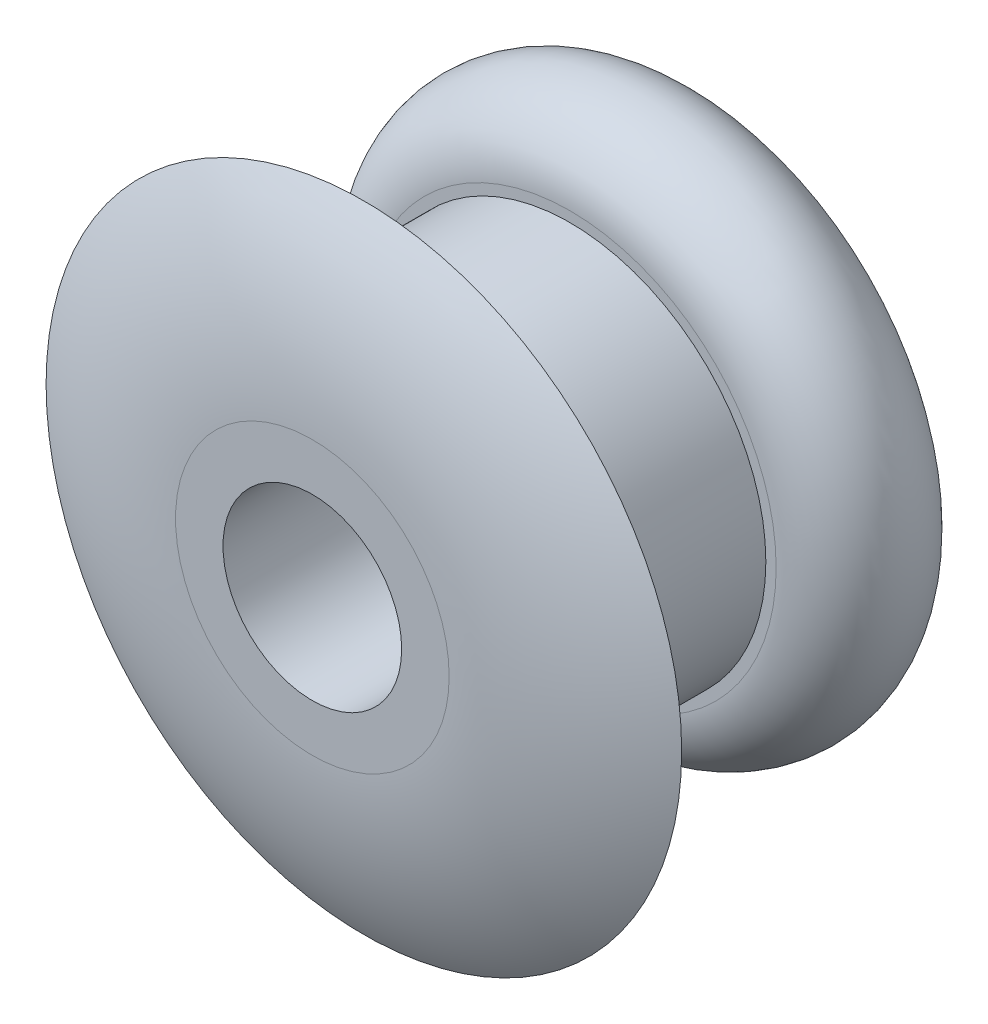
from build123d import *


with BuildPart() as part:
    # Esquisse1 → Base-R_volution (revolve)
    with BuildSketch(Plane(origin=(0, 0, 0), x_dir=(0, 0, -1), z_dir=(1, 0, 0)), mode=Mode.PRIVATE) as base_r_volution_sk:
        with BuildLine():
            Line((0, 1.3), (0, 1.991086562))
            ThreePointArc((0, 1.991086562), (0.191153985, 3.360392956), (0.75, 4.625))
            Line((0.75, 4.625), (0.75, 2.85))
            Line((0.75, 2.85), (3.75, 2.85))
            Line((3.75, 2.85), (3.75, 3))
            ThreePointArc((3.75, 3), (4.75, 4), (5.75, 3))
            Line((5.75, 3), (5.75, 1.73))
            Line((5.75, 1.73), (4.5, 1.73))
            Line((4.5, 1.73), (4.5, 1.3))
            Line((4.5, 1.3), (0, 1.3))
        make_face()
    revolve(base_r_volution_sk.sketch.rotate(Axis((0, 0, 4.539350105), (0, 0, -1)), 90), axis=Axis((0, 0, 4.539350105), (0, 0, -1)))


solid = part.part
